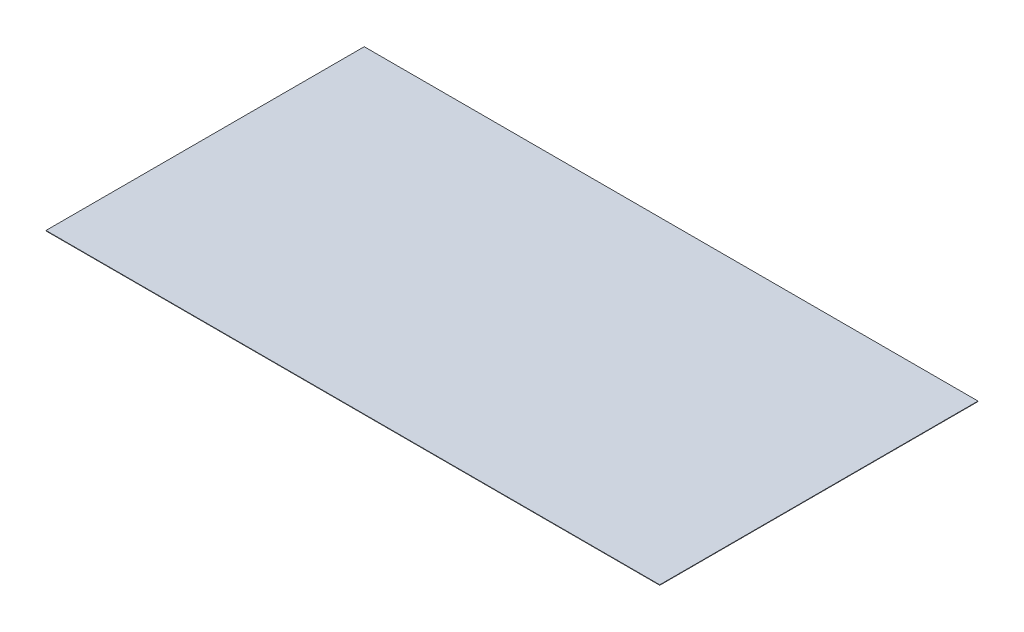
ISO-10303-21;
HEADER;
FILE_DESCRIPTION(('STEP AP214'),'2;1');
FILE_NAME('part.step','',(''),(''),'','','');
FILE_SCHEMA(('AUTOMOTIVE_DESIGN { 1 0 10303 214 1 1 1 1 }'));
ENDSEC;
DATA;
#1=APPLICATION_CONTEXT('core data for automotive mechanical design processes');
#2=APPLICATION_PROTOCOL_DEFINITION('international standard','automotive_design',2000,#1);
#3=PRODUCT_CONTEXT('',#1,'mechanical');
#4=PRODUCT('Part','Part','',(#3));
#5=PRODUCT_RELATED_PRODUCT_CATEGORY('part','',(#4));
#6=PRODUCT_DEFINITION_FORMATION('','',#4);
#7=PRODUCT_DEFINITION_CONTEXT('part definition',#1,'design');
#8=PRODUCT_DEFINITION('design','',#6,#7);
#9=PRODUCT_DEFINITION_SHAPE('','',#8);
#10=(LENGTH_UNIT() NAMED_UNIT(*) SI_UNIT(.MILLI.,.METRE.));
#11=(NAMED_UNIT(*) PLANE_ANGLE_UNIT() SI_UNIT($,.RADIAN.));
#12=(NAMED_UNIT(*) SI_UNIT($,.STERADIAN.) SOLID_ANGLE_UNIT());
#13=UNCERTAINTY_MEASURE_WITH_UNIT(LENGTH_MEASURE(1.E-05),#10,'distance_accuracy_value','');
#14=(GEOMETRIC_REPRESENTATION_CONTEXT(3) GLOBAL_UNCERTAINTY_ASSIGNED_CONTEXT((#13)) GLOBAL_UNIT_ASSIGNED_CONTEXT((#10,
#11,#12)) REPRESENTATION_CONTEXT('',''));
#15=CARTESIAN_POINT('',(0.,0.,0.));
#16=DIRECTION('',(0.,0.,1.));
#17=DIRECTION('',(1.,0.,0.));
#18=AXIS2_PLACEMENT_3D('',#15,#16,#17);
#19=CARTESIAN_POINT('',(685.8,-1.,355.6));
#20=DIRECTION('',(1.,0.,0.));
#21=DIRECTION('',(0.,0.,-1.));
#22=AXIS2_PLACEMENT_3D('',#19,#20,#21);
#23=PLANE('',#22);
#24=DIRECTION('',(0.,0.,-1.));
#25=VECTOR('',#24,1.);
#26=CARTESIAN_POINT('',(685.8,0.,355.6));
#27=LINE('',#26,#25);
#28=CARTESIAN_POINT('',(685.8,0.,355.6));
#29=VERTEX_POINT('',#28);
#30=CARTESIAN_POINT('',(685.8,0.,-355.6));
#31=VERTEX_POINT('',#30);
#32=EDGE_CURVE('E114',#29,#31,#27,.T.);
#33=ORIENTED_EDGE('',*,*,#32,.F.);
#34=DIRECTION('',(0.,1.,0.));
#35=VECTOR('',#34,1.);
#36=CARTESIAN_POINT('',(685.8,-1.,355.6));
#37=LINE('',#36,#35);
#38=CARTESIAN_POINT('',(685.8,-1.,355.6));
#39=VERTEX_POINT('',#38);
#40=EDGE_CURVE('E11',#39,#29,#37,.T.);
#41=ORIENTED_EDGE('',*,*,#40,.F.);
#42=DIRECTION('',(0.,0.,-1.));
#43=VECTOR('',#42,1.);
#44=CARTESIAN_POINT('',(685.8,-1.,355.6));
#45=LINE('',#44,#43);
#46=CARTESIAN_POINT('',(685.8,-1.,-355.6));
#47=VERTEX_POINT('',#46);
#48=EDGE_CURVE('E108',#39,#47,#45,.T.);
#49=ORIENTED_EDGE('',*,*,#48,.T.);
#50=DIRECTION('',(0.,1.,0.));
#51=VECTOR('',#50,1.);
#52=CARTESIAN_POINT('',(685.8,-1.,-355.6));
#53=LINE('',#52,#51);
#54=EDGE_CURVE('E45',#47,#31,#53,.T.);
#55=ORIENTED_EDGE('',*,*,#54,.T.);
#56=EDGE_LOOP('',(#33,#41,#49,#55));
#57=FACE_BOUND('',#56,.T.);
#58=ADVANCED_FACE('F42',(#57),#23,.T.);
#59=CARTESIAN_POINT('',(-685.8,-1.,355.6));
#60=DIRECTION('',(0.,0.,1.));
#61=DIRECTION('',(1.,0.,0.));
#62=AXIS2_PLACEMENT_3D('',#59,#60,#61);
#63=PLANE('',#62);
#64=DIRECTION('',(1.,0.,0.));
#65=VECTOR('',#64,1.);
#66=CARTESIAN_POINT('',(-685.8,0.,355.6));
#67=LINE('',#66,#65);
#68=CARTESIAN_POINT('',(-685.8,0.,355.6));
#69=VERTEX_POINT('',#68);
#70=EDGE_CURVE('E110',#69,#29,#67,.T.);
#71=ORIENTED_EDGE('',*,*,#70,.F.);
#72=DIRECTION('',(0.,1.,0.));
#73=VECTOR('',#72,1.);
#74=CARTESIAN_POINT('',(-685.8,-1.,355.6));
#75=LINE('',#74,#73);
#76=CARTESIAN_POINT('',(-685.8,-1.,355.6));
#77=VERTEX_POINT('',#76);
#78=EDGE_CURVE('E51',#77,#69,#75,.T.);
#79=ORIENTED_EDGE('',*,*,#78,.F.);
#80=DIRECTION('',(1.,0.,0.));
#81=VECTOR('',#80,1.);
#82=CARTESIAN_POINT('',(-685.8,-1.,355.6));
#83=LINE('',#82,#81);
#84=EDGE_CURVE('E105',#77,#39,#83,.T.);
#85=ORIENTED_EDGE('',*,*,#84,.T.);
#86=ORIENTED_EDGE('',*,*,#40,.T.);
#87=EDGE_LOOP('',(#71,#79,#85,#86));
#88=FACE_BOUND('',#87,.T.);
#89=ADVANCED_FACE('F124',(#88),#63,.T.);
#90=CARTESIAN_POINT('',(-685.8,-1.,355.6));
#91=DIRECTION('',(-1.,0.,0.));
#92=DIRECTION('',(0.,0.,1.));
#93=AXIS2_PLACEMENT_3D('',#90,#91,#92);
#94=PLANE('',#93);
#95=DIRECTION('',(0.,0.,1.));
#96=VECTOR('',#95,1.);
#97=CARTESIAN_POINT('',(-685.8,0.,355.6));
#98=LINE('',#97,#96);
#99=CARTESIAN_POINT('',(-685.8,0.,-355.6));
#100=VERTEX_POINT('',#99);
#101=EDGE_CURVE('E100',#100,#69,#98,.T.);
#102=ORIENTED_EDGE('',*,*,#101,.F.);
#103=DIRECTION('',(0.,1.,0.));
#104=VECTOR('',#103,1.);
#105=CARTESIAN_POINT('',(-685.8,-1.,-355.6));
#106=LINE('',#105,#104);
#107=CARTESIAN_POINT('',(-685.8,-1.,-355.6));
#108=VERTEX_POINT('',#107);
#109=EDGE_CURVE('E95',#108,#100,#106,.T.);
#110=ORIENTED_EDGE('',*,*,#109,.F.);
#111=DIRECTION('',(0.,0.,1.));
#112=VECTOR('',#111,1.);
#113=CARTESIAN_POINT('',(-685.8,-1.,355.6));
#114=LINE('',#113,#112);
#115=EDGE_CURVE('E98',#108,#77,#114,.T.);
#116=ORIENTED_EDGE('',*,*,#115,.T.);
#117=ORIENTED_EDGE('',*,*,#78,.T.);
#118=EDGE_LOOP('',(#102,#110,#116,#117));
#119=FACE_BOUND('',#118,.T.);
#120=ADVANCED_FACE('F97',(#119),#94,.T.);
#121=CARTESIAN_POINT('',(-685.8,-1.,-355.6));
#122=DIRECTION('',(0.,0.,-1.));
#123=DIRECTION('',(-1.,0.,0.));
#124=AXIS2_PLACEMENT_3D('',#121,#122,#123);
#125=PLANE('',#124);
#126=DIRECTION('',(-1.,0.,0.));
#127=VECTOR('',#126,1.);
#128=CARTESIAN_POINT('',(-685.8,0.,-355.6));
#129=LINE('',#128,#127);
#130=EDGE_CURVE('E117',#31,#100,#129,.T.);
#131=ORIENTED_EDGE('',*,*,#130,.F.);
#132=ORIENTED_EDGE('',*,*,#54,.F.);
#133=DIRECTION('',(-1.,0.,0.));
#134=VECTOR('',#133,1.);
#135=CARTESIAN_POINT('',(-685.8,-1.,-355.6));
#136=LINE('',#135,#134);
#137=EDGE_CURVE('E104',#47,#108,#136,.T.);
#138=ORIENTED_EDGE('',*,*,#137,.T.);
#139=ORIENTED_EDGE('',*,*,#109,.T.);
#140=EDGE_LOOP('',(#131,#132,#138,#139));
#141=FACE_BOUND('',#140,.T.);
#142=ADVANCED_FACE('F107',(#141),#125,.T.);
#143=CARTESIAN_POINT('',(0.,-1.,0.));
#144=DIRECTION('',(0.,-1.,0.));
#145=DIRECTION('',(0.,0.,-1.));
#146=AXIS2_PLACEMENT_3D('',#143,#144,#145);
#147=PLANE('',#146);
#148=ORIENTED_EDGE('',*,*,#48,.F.);
#149=ORIENTED_EDGE('',*,*,#84,.F.);
#150=ORIENTED_EDGE('',*,*,#115,.F.);
#151=ORIENTED_EDGE('',*,*,#137,.F.);
#152=EDGE_LOOP('',(#148,#149,#150,#151));
#153=FACE_BOUND('',#152,.T.);
#154=ADVANCED_FACE('F103',(#153),#147,.T.);
#155=CARTESIAN_POINT('',(0.,0.,0.));
#156=DIRECTION('',(0.,-1.,0.));
#157=DIRECTION('',(0.,0.,-1.));
#158=AXIS2_PLACEMENT_3D('',#155,#156,#157);
#159=PLANE('',#158);
#160=ORIENTED_EDGE('',*,*,#32,.T.);
#161=ORIENTED_EDGE('',*,*,#130,.T.);
#162=ORIENTED_EDGE('',*,*,#101,.T.);
#163=ORIENTED_EDGE('',*,*,#70,.T.);
#164=EDGE_LOOP('',(#160,#161,#162,#163));
#165=FACE_BOUND('',#164,.T.);
#166=ADVANCED_FACE('F123',(#165),#159,.F.);
#167=CLOSED_SHELL('',(#58,#89,#120,#142,#154,#166));
#168=MANIFOLD_SOLID_BREP('B2',#167);
#169=ADVANCED_BREP_SHAPE_REPRESENTATION('',(#18,#168),#14);
#170=SHAPE_DEFINITION_REPRESENTATION(#9,#169);
ENDSEC;
END-ISO-10303-21;
